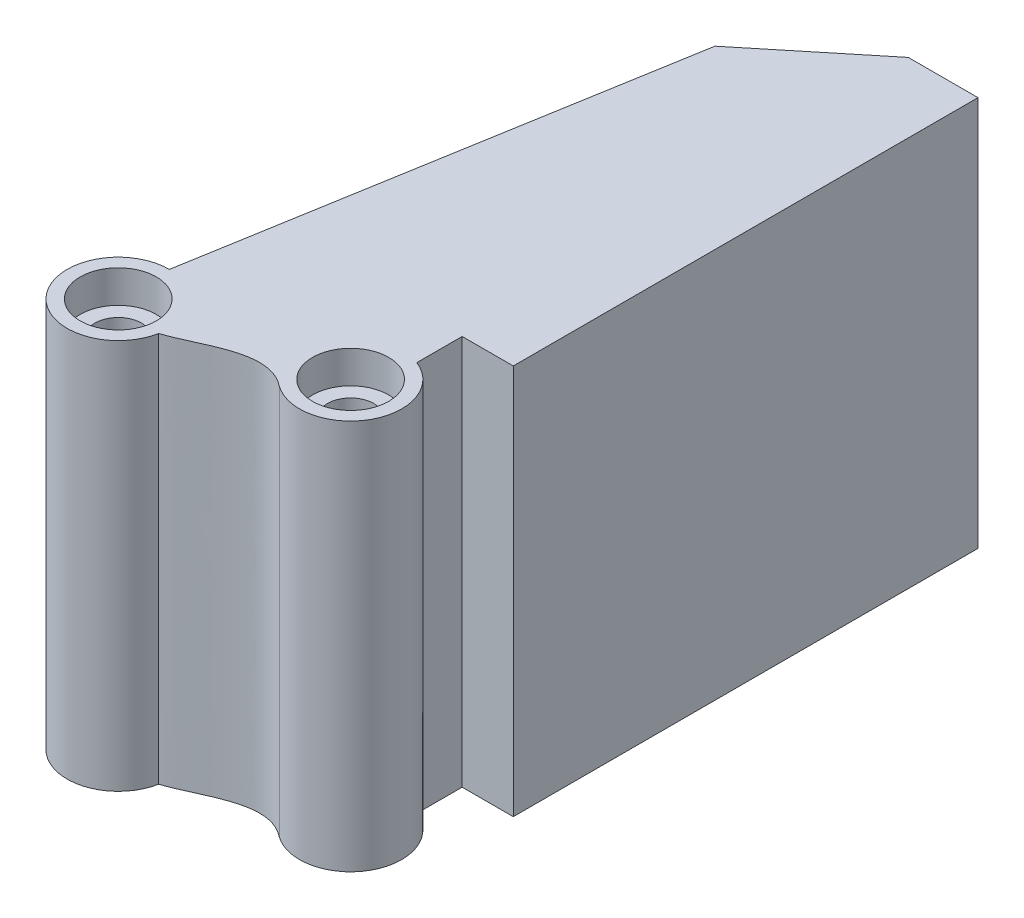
ISO-10303-21;
HEADER;
FILE_DESCRIPTION(('STEP AP214'),'2;1');
FILE_NAME('part.step','',(''),(''),'','','');
FILE_SCHEMA(('AUTOMOTIVE_DESIGN { 1 0 10303 214 1 1 1 1 }'));
ENDSEC;
DATA;
#1=APPLICATION_CONTEXT('core data for automotive mechanical design processes');
#2=APPLICATION_PROTOCOL_DEFINITION('international standard','automotive_design',2000,#1);
#3=PRODUCT_CONTEXT('',#1,'mechanical');
#4=PRODUCT('Part','Part','',(#3));
#5=PRODUCT_RELATED_PRODUCT_CATEGORY('part','',(#4));
#6=PRODUCT_DEFINITION_FORMATION('','',#4);
#7=PRODUCT_DEFINITION_CONTEXT('part definition',#1,'design');
#8=PRODUCT_DEFINITION('design','',#6,#7);
#9=PRODUCT_DEFINITION_SHAPE('','',#8);
#10=(LENGTH_UNIT() NAMED_UNIT(*) SI_UNIT(.MILLI.,.METRE.));
#11=(NAMED_UNIT(*) PLANE_ANGLE_UNIT() SI_UNIT($,.RADIAN.));
#12=(NAMED_UNIT(*) SI_UNIT($,.STERADIAN.) SOLID_ANGLE_UNIT());
#13=UNCERTAINTY_MEASURE_WITH_UNIT(LENGTH_MEASURE(1.E-05),#10,'distance_accuracy_value','');
#14=(GEOMETRIC_REPRESENTATION_CONTEXT(3) GLOBAL_UNCERTAINTY_ASSIGNED_CONTEXT((#13)) GLOBAL_UNIT_ASSIGNED_CONTEXT((#10,
#11,#12)) REPRESENTATION_CONTEXT('',''));
#15=CARTESIAN_POINT('',(0.,0.,0.));
#16=DIRECTION('',(0.,0.,1.));
#17=DIRECTION('',(1.,0.,0.));
#18=AXIS2_PLACEMENT_3D('',#15,#16,#17);
#19=CARTESIAN_POINT('',(-7.5,21.,-91.3416008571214));
#20=DIRECTION('',(0.,-1.,0.));
#21=DIRECTION('',(0.,0.,-1.));
#22=AXIS2_PLACEMENT_3D('',#19,#20,#21);
#23=CYLINDRICAL_SURFACE('',#22,2.5);
#24=CARTESIAN_POINT('',(-7.5,17.5,-91.3416008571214));
#25=DIRECTION('',(0.,1.,0.));
#26=DIRECTION('',(0.,0.,1.));
#27=AXIS2_PLACEMENT_3D('',#24,#25,#26);
#28=CIRCLE('',#27,2.5);
#29=CARTESIAN_POINT('',(-7.5,17.5,-93.8416008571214));
#30=VERTEX_POINT('',#29);
#31=EDGE_CURVE('E272',#30,#30,#28,.T.);
#32=CARTESIAN_POINT('',(-7.5,-17.5,-91.3416008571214));
#33=DIRECTION('',(0.,-1.,0.));
#34=DIRECTION('',(0.,0.,-1.));
#35=AXIS2_PLACEMENT_3D('',#32,#33,#34);
#36=CIRCLE('',#35,2.5);
#37=CARTESIAN_POINT('',(-7.5,-17.5,-93.8416008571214));
#38=VERTEX_POINT('',#37);
#39=EDGE_CURVE('E119',#38,#38,#36,.T.);
#40=CARTESIAN_POINT('',(-7.5,17.5,-93.8416008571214));
#41=CARTESIAN_POINT('',(-7.5,17.1354166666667,-93.8416008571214));
#42=CARTESIAN_POINT('',(-7.5,16.7708333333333,-93.8416008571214));
#43=CARTESIAN_POINT('',(-7.5,16.0416666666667,-93.8416008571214));
#44=CARTESIAN_POINT('',(-7.5,15.6770833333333,-93.8416008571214));
#45=CARTESIAN_POINT('',(-7.5,14.9479166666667,-93.8416008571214));
#46=CARTESIAN_POINT('',(-7.5,14.5833333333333,-93.8416008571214));
#47=CARTESIAN_POINT('',(-7.5,13.8541666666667,-93.8416008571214));
#48=CARTESIAN_POINT('',(-7.5,13.4895833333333,-93.8416008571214));
#49=CARTESIAN_POINT('',(-7.5,12.7604166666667,-93.8416008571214));
#50=CARTESIAN_POINT('',(-7.5,12.3958333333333,-93.8416008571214));
#51=CARTESIAN_POINT('',(-7.5,11.6666666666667,-93.8416008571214));
#52=CARTESIAN_POINT('',(-7.5,11.3020833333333,-93.8416008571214));
#53=CARTESIAN_POINT('',(-7.5,10.5729166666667,-93.8416008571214));
#54=CARTESIAN_POINT('',(-7.5,10.2083333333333,-93.8416008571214));
#55=CARTESIAN_POINT('',(-7.5,9.47916666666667,-93.8416008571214));
#56=CARTESIAN_POINT('',(-7.5,9.11458333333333,-93.8416008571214));
#57=CARTESIAN_POINT('',(-7.5,8.38541666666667,-93.8416008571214));
#58=CARTESIAN_POINT('',(-7.5,8.02083333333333,-93.8416008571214));
#59=CARTESIAN_POINT('',(-7.5,7.29166666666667,-93.8416008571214));
#60=CARTESIAN_POINT('',(-7.5,6.92708333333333,-93.8416008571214));
#61=CARTESIAN_POINT('',(-7.5,6.19791666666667,-93.8416008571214));
#62=CARTESIAN_POINT('',(-7.5,5.83333333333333,-93.8416008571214));
#63=CARTESIAN_POINT('',(-7.5,5.10416666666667,-93.8416008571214));
#64=CARTESIAN_POINT('',(-7.5,4.73958333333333,-93.8416008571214));
#65=CARTESIAN_POINT('',(-7.5,4.01041666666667,-93.8416008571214));
#66=CARTESIAN_POINT('',(-7.5,3.64583333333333,-93.8416008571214));
#67=CARTESIAN_POINT('',(-7.5,2.91666666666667,-93.8416008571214));
#68=CARTESIAN_POINT('',(-7.5,2.55208333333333,-93.8416008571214));
#69=CARTESIAN_POINT('',(-7.5,1.82291666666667,-93.8416008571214));
#70=CARTESIAN_POINT('',(-7.5,1.45833333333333,-93.8416008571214));
#71=CARTESIAN_POINT('',(-7.5,0.729166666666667,-93.8416008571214));
#72=CARTESIAN_POINT('',(-7.5,0.364583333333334,-93.8416008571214));
#73=CARTESIAN_POINT('',(-7.5,-0.364583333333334,-93.8416008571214));
#74=CARTESIAN_POINT('',(-7.5,-0.729166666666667,-93.8416008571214));
#75=CARTESIAN_POINT('',(-7.5,-1.45833333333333,-93.8416008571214));
#76=CARTESIAN_POINT('',(-7.5,-1.82291666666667,-93.8416008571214));
#77=CARTESIAN_POINT('',(-7.5,-2.55208333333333,-93.8416008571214));
#78=CARTESIAN_POINT('',(-7.5,-2.91666666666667,-93.8416008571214));
#79=CARTESIAN_POINT('',(-7.5,-3.64583333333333,-93.8416008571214));
#80=CARTESIAN_POINT('',(-7.5,-4.01041666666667,-93.8416008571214));
#81=CARTESIAN_POINT('',(-7.5,-4.73958333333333,-93.8416008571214));
#82=CARTESIAN_POINT('',(-7.5,-5.10416666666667,-93.8416008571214));
#83=CARTESIAN_POINT('',(-7.5,-5.83333333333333,-93.8416008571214));
#84=CARTESIAN_POINT('',(-7.5,-6.19791666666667,-93.8416008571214));
#85=CARTESIAN_POINT('',(-7.5,-6.92708333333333,-93.8416008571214));
#86=CARTESIAN_POINT('',(-7.5,-7.29166666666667,-93.8416008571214));
#87=CARTESIAN_POINT('',(-7.5,-8.02083333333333,-93.8416008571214));
#88=CARTESIAN_POINT('',(-7.5,-8.38541666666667,-93.8416008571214));
#89=CARTESIAN_POINT('',(-7.5,-9.11458333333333,-93.8416008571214));
#90=CARTESIAN_POINT('',(-7.5,-9.47916666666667,-93.8416008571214));
#91=CARTESIAN_POINT('',(-7.5,-10.2083333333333,-93.8416008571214));
#92=CARTESIAN_POINT('',(-7.5,-10.5729166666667,-93.8416008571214));
#93=CARTESIAN_POINT('',(-7.5,-11.3020833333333,-93.8416008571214));
#94=CARTESIAN_POINT('',(-7.5,-11.6666666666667,-93.8416008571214));
#95=CARTESIAN_POINT('',(-7.5,-12.3958333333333,-93.8416008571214));
#96=CARTESIAN_POINT('',(-7.5,-12.7604166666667,-93.8416008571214));
#97=CARTESIAN_POINT('',(-7.5,-13.4895833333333,-93.8416008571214));
#98=CARTESIAN_POINT('',(-7.5,-13.8541666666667,-93.8416008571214));
#99=CARTESIAN_POINT('',(-7.5,-14.5833333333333,-93.8416008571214));
#100=CARTESIAN_POINT('',(-7.5,-14.9479166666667,-93.8416008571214));
#101=CARTESIAN_POINT('',(-7.5,-15.6770833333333,-93.8416008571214));
#102=CARTESIAN_POINT('',(-7.5,-16.0416666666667,-93.8416008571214));
#103=CARTESIAN_POINT('',(-7.5,-16.7708333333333,-93.8416008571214));
#104=CARTESIAN_POINT('',(-7.5,-17.1354166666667,-93.8416008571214));
#105=CARTESIAN_POINT('',(-7.5,-17.5,-93.8416008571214));
#106=B_SPLINE_CURVE_WITH_KNOTS('',3,(#40,#41,#42,#43,#44,#45,#46,#47,#48,#49,#50,#51,#52,#53,
#54,#55,#56,#57,#58,#59,#60,#61,#62,#63,#64,#65,#66,#67,#68,#69,#70,#71,#72,#73,#74,#75,#76,#77,
#78,#79,#80,#81,#82,#83,#84,#85,#86,#87,#88,#89,#90,#91,#92,#93,#94,#95,#96,#97,#98,#99,#100,
#101,#102,#103,#104,#105),.UNSPECIFIED.,.F.,.F.,(4,2,2,2,2,2,2,2,2,2,2,2,2,2,2,2,2,2,2,2,2,2,2,
2,2,2,2,2,2,2,2,2,4),(0.,1.09375,2.1875,3.28125,4.375,5.46875,6.5625,7.65625,8.75,9.84375,
10.9375,12.03125,13.125,14.21875,15.3125,16.40625,17.5,18.59375,19.6875,20.78125,21.875,
22.96875,24.0625,25.15625,26.25,27.34375,28.4375,29.53125,30.625,31.71875,32.8125,33.90625,35.),.UNSPECIFIED.);
#107=EDGE_CURVE('BSEAM115',#30,#38,#106,.T.);
#108=ORIENTED_EDGE('',*,*,#31,.T.);
#109=ORIENTED_EDGE('',*,*,#39,.T.);
#110=ORIENTED_EDGE('',*,*,#107,.T.);
#111=ORIENTED_EDGE('',*,*,#107,.F.);
#112=EDGE_LOOP('',(#108,#110,#109,#111));
#113=FACE_BOUND('',#112,.T.);
#114=ADVANCED_FACE('F115',(#113),#23,.F.);
#115=CARTESIAN_POINT('',(-27.5,21.,-86.3416008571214));
#116=DIRECTION('',(0.,-1.,0.));
#117=DIRECTION('',(0.,0.,-1.));
#118=AXIS2_PLACEMENT_3D('',#115,#116,#117);
#119=CYLINDRICAL_SURFACE('',#118,2.5);
#120=CARTESIAN_POINT('',(-27.5,17.5,-86.3416008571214));
#121=DIRECTION('',(0.,1.,0.));
#122=DIRECTION('',(0.,0.,1.));
#123=AXIS2_PLACEMENT_3D('',#120,#121,#122);
#124=CIRCLE('',#123,2.5);
#125=CARTESIAN_POINT('',(-27.5,17.5,-88.8416008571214));
#126=VERTEX_POINT('',#125);
#127=EDGE_CURVE('E290',#126,#126,#124,.T.);
#128=CARTESIAN_POINT('',(-27.5,-17.5,-86.3416008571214));
#129=DIRECTION('',(0.,-1.,0.));
#130=DIRECTION('',(0.,0.,-1.));
#131=AXIS2_PLACEMENT_3D('',#128,#129,#130);
#132=CIRCLE('',#131,2.5);
#133=CARTESIAN_POINT('',(-27.5,-17.5,-88.8416008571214));
#134=VERTEX_POINT('',#133);
#135=EDGE_CURVE('E277',#134,#134,#132,.T.);
#136=CARTESIAN_POINT('',(-27.5,17.5,-88.8416008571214));
#137=CARTESIAN_POINT('',(-27.5,17.1354166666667,-88.8416008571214));
#138=CARTESIAN_POINT('',(-27.5,16.7708333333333,-88.8416008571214));
#139=CARTESIAN_POINT('',(-27.5,16.0416666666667,-88.8416008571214));
#140=CARTESIAN_POINT('',(-27.5,15.6770833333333,-88.8416008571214));
#141=CARTESIAN_POINT('',(-27.5,14.9479166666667,-88.8416008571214));
#142=CARTESIAN_POINT('',(-27.5,14.5833333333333,-88.8416008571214));
#143=CARTESIAN_POINT('',(-27.5,13.8541666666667,-88.8416008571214));
#144=CARTESIAN_POINT('',(-27.5,13.4895833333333,-88.8416008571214));
#145=CARTESIAN_POINT('',(-27.5,12.7604166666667,-88.8416008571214));
#146=CARTESIAN_POINT('',(-27.5,12.3958333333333,-88.8416008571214));
#147=CARTESIAN_POINT('',(-27.5,11.6666666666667,-88.8416008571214));
#148=CARTESIAN_POINT('',(-27.5,11.3020833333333,-88.8416008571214));
#149=CARTESIAN_POINT('',(-27.5,10.5729166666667,-88.8416008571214));
#150=CARTESIAN_POINT('',(-27.5,10.2083333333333,-88.8416008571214));
#151=CARTESIAN_POINT('',(-27.5,9.47916666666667,-88.8416008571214));
#152=CARTESIAN_POINT('',(-27.5,9.11458333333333,-88.8416008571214));
#153=CARTESIAN_POINT('',(-27.5,8.38541666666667,-88.8416008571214));
#154=CARTESIAN_POINT('',(-27.5,8.02083333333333,-88.8416008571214));
#155=CARTESIAN_POINT('',(-27.5,7.29166666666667,-88.8416008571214));
#156=CARTESIAN_POINT('',(-27.5,6.92708333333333,-88.8416008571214));
#157=CARTESIAN_POINT('',(-27.5,6.19791666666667,-88.8416008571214));
#158=CARTESIAN_POINT('',(-27.5,5.83333333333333,-88.8416008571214));
#159=CARTESIAN_POINT('',(-27.5,5.10416666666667,-88.8416008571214));
#160=CARTESIAN_POINT('',(-27.5,4.73958333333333,-88.8416008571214));
#161=CARTESIAN_POINT('',(-27.5,4.01041666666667,-88.8416008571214));
#162=CARTESIAN_POINT('',(-27.5,3.64583333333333,-88.8416008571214));
#163=CARTESIAN_POINT('',(-27.5,2.91666666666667,-88.8416008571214));
#164=CARTESIAN_POINT('',(-27.5,2.55208333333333,-88.8416008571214));
#165=CARTESIAN_POINT('',(-27.5,1.82291666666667,-88.8416008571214));
#166=CARTESIAN_POINT('',(-27.5,1.45833333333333,-88.8416008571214));
#167=CARTESIAN_POINT('',(-27.5,0.729166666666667,-88.8416008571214));
#168=CARTESIAN_POINT('',(-27.5,0.364583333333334,-88.8416008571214));
#169=CARTESIAN_POINT('',(-27.5,-0.364583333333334,-88.8416008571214));
#170=CARTESIAN_POINT('',(-27.5,-0.729166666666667,-88.8416008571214));
#171=CARTESIAN_POINT('',(-27.5,-1.45833333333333,-88.8416008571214));
#172=CARTESIAN_POINT('',(-27.5,-1.82291666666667,-88.8416008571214));
#173=CARTESIAN_POINT('',(-27.5,-2.55208333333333,-88.8416008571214));
#174=CARTESIAN_POINT('',(-27.5,-2.91666666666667,-88.8416008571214));
#175=CARTESIAN_POINT('',(-27.5,-3.64583333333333,-88.8416008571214));
#176=CARTESIAN_POINT('',(-27.5,-4.01041666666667,-88.8416008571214));
#177=CARTESIAN_POINT('',(-27.5,-4.73958333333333,-88.8416008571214));
#178=CARTESIAN_POINT('',(-27.5,-5.10416666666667,-88.8416008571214));
#179=CARTESIAN_POINT('',(-27.5,-5.83333333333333,-88.8416008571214));
#180=CARTESIAN_POINT('',(-27.5,-6.19791666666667,-88.8416008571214));
#181=CARTESIAN_POINT('',(-27.5,-6.92708333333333,-88.8416008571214));
#182=CARTESIAN_POINT('',(-27.5,-7.29166666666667,-88.8416008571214));
#183=CARTESIAN_POINT('',(-27.5,-8.02083333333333,-88.8416008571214));
#184=CARTESIAN_POINT('',(-27.5,-8.38541666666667,-88.8416008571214));
#185=CARTESIAN_POINT('',(-27.5,-9.11458333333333,-88.8416008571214));
#186=CARTESIAN_POINT('',(-27.5,-9.47916666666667,-88.8416008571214));
#187=CARTESIAN_POINT('',(-27.5,-10.2083333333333,-88.8416008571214));
#188=CARTESIAN_POINT('',(-27.5,-10.5729166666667,-88.8416008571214));
#189=CARTESIAN_POINT('',(-27.5,-11.3020833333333,-88.8416008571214));
#190=CARTESIAN_POINT('',(-27.5,-11.6666666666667,-88.8416008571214));
#191=CARTESIAN_POINT('',(-27.5,-12.3958333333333,-88.8416008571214));
#192=CARTESIAN_POINT('',(-27.5,-12.7604166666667,-88.8416008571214));
#193=CARTESIAN_POINT('',(-27.5,-13.4895833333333,-88.8416008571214));
#194=CARTESIAN_POINT('',(-27.5,-13.8541666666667,-88.8416008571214));
#195=CARTESIAN_POINT('',(-27.5,-14.5833333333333,-88.8416008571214));
#196=CARTESIAN_POINT('',(-27.5,-14.9479166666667,-88.8416008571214));
#197=CARTESIAN_POINT('',(-27.5,-15.6770833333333,-88.8416008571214));
#198=CARTESIAN_POINT('',(-27.5,-16.0416666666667,-88.8416008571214));
#199=CARTESIAN_POINT('',(-27.5,-16.7708333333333,-88.8416008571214));
#200=CARTESIAN_POINT('',(-27.5,-17.1354166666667,-88.8416008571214));
#201=CARTESIAN_POINT('',(-27.5,-17.5,-88.8416008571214));
#202=B_SPLINE_CURVE_WITH_KNOTS('',3,(#136,#137,#138,#139,#140,#141,#142,#143,#144,#145,#146,
#147,#148,#149,#150,#151,#152,#153,#154,#155,#156,#157,#158,#159,#160,#161,#162,#163,#164,#165,
#166,#167,#168,#169,#170,#171,#172,#173,#174,#175,#176,#177,#178,#179,#180,#181,#182,#183,#184,
#185,#186,#187,#188,#189,#190,#191,#192,#193,#194,#195,#196,#197,#198,#199,#200,#201),
.UNSPECIFIED.,.F.,.F.,(4,2,2,2,2,2,2,2,2,2,2,2,2,2,2,2,2,2,2,2,2,2,2,2,2,2,2,2,2,2,2,2,4),(0.,
1.09375,2.1875,3.28125,4.375,5.46875,6.5625,7.65625,8.75,9.84375,10.9375,12.03125,13.125,
14.21875,15.3125,16.40625,17.5,18.59375,19.6875,20.78125,21.875,22.96875,24.0625,25.15625,26.25,
27.34375,28.4375,29.53125,30.625,31.71875,32.8125,33.90625,35.),.UNSPECIFIED.);
#203=EDGE_CURVE('BSEAM117',#126,#134,#202,.T.);
#204=ORIENTED_EDGE('',*,*,#127,.T.);
#205=ORIENTED_EDGE('',*,*,#135,.T.);
#206=ORIENTED_EDGE('',*,*,#203,.T.);
#207=ORIENTED_EDGE('',*,*,#203,.F.);
#208=EDGE_LOOP('',(#204,#206,#205,#207));
#209=FACE_BOUND('',#208,.T.);
#210=ADVANCED_FACE('F117',(#209),#119,.F.);
#211=CARTESIAN_POINT('',(-5.5,21.,0.));
#212=DIRECTION('',(1.,0.,0.));
#213=DIRECTION('',(0.,0.,-1.));
#214=AXIS2_PLACEMENT_3D('',#211,#212,#213);
#215=PLANE('',#214);
#216=DIRECTION('',(0.,0.,1.));
#217=VECTOR('',#216,1.);
#218=CARTESIAN_POINT('',(-5.5,-21.,0.));
#219=LINE('',#218,#217);
#220=CARTESIAN_POINT('',(-5.5,-21.,-101.341600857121));
#221=VERTEX_POINT('',#220);
#222=CARTESIAN_POINT('',(-5.5,-21.,-96.4650762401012));
#223=VERTEX_POINT('',#222);
#224=EDGE_CURVE('E325',#221,#223,#219,.T.);
#225=ORIENTED_EDGE('',*,*,#224,.F.);
#226=DIRECTION('',(0.,-1.,0.));
#227=VECTOR('',#226,1.);
#228=CARTESIAN_POINT('',(-5.5,21.,-101.341600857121));
#229=LINE('',#228,#227);
#230=CARTESIAN_POINT('',(-5.5,21.,-101.341600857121));
#231=VERTEX_POINT('',#230);
#232=EDGE_CURVE('E125',#231,#221,#229,.T.);
#233=ORIENTED_EDGE('',*,*,#232,.F.);
#234=DIRECTION('',(0.,0.,1.));
#235=VECTOR('',#234,1.);
#236=CARTESIAN_POINT('',(-5.5,21.,0.));
#237=LINE('',#236,#235);
#238=CARTESIAN_POINT('',(-5.5,21.,-96.4650762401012));
#239=VERTEX_POINT('',#238);
#240=EDGE_CURVE('E343',#231,#239,#237,.T.);
#241=ORIENTED_EDGE('',*,*,#240,.T.);
#242=DIRECTION('',(0.,-1.,0.));
#243=VECTOR('',#242,1.);
#244=CARTESIAN_POINT('',(-5.5,21.,-96.4650762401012));
#245=LINE('',#244,#243);
#246=EDGE_CURVE('E12',#239,#223,#245,.T.);
#247=ORIENTED_EDGE('',*,*,#246,.T.);
#248=EDGE_LOOP('',(#225,#233,#241,#247));
#249=FACE_BOUND('',#248,.T.);
#250=ADVANCED_FACE('F253',(#249),#215,.T.);
#251=CARTESIAN_POINT('',(0.,21.,-101.341600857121));
#252=DIRECTION('',(0.,0.,1.));
#253=DIRECTION('',(1.,0.,0.));
#254=AXIS2_PLACEMENT_3D('',#251,#252,#253);
#255=PLANE('',#254);
#256=DIRECTION('',(-1.,0.,0.));
#257=VECTOR('',#256,1.);
#258=CARTESIAN_POINT('',(0.,-21.,-101.341600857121));
#259=LINE('',#258,#257);
#260=CARTESIAN_POINT('',(0.,-21.,-101.341600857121));
#261=VERTEX_POINT('',#260);
#262=EDGE_CURVE('E323',#261,#221,#259,.T.);
#263=ORIENTED_EDGE('',*,*,#262,.F.);
#264=DIRECTION('',(0.,-1.,0.));
#265=VECTOR('',#264,1.);
#266=CARTESIAN_POINT('',(0.,21.,-101.341600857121));
#267=LINE('',#266,#265);
#268=CARTESIAN_POINT('',(0.,21.,-101.341600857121));
#269=VERTEX_POINT('',#268);
#270=EDGE_CURVE('E295',#269,#261,#267,.T.);
#271=ORIENTED_EDGE('',*,*,#270,.F.);
#272=DIRECTION('',(-1.,0.,0.));
#273=VECTOR('',#272,1.);
#274=CARTESIAN_POINT('',(0.,21.,-101.341600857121));
#275=LINE('',#274,#273);
#276=EDGE_CURVE('E342',#269,#231,#275,.T.);
#277=ORIENTED_EDGE('',*,*,#276,.T.);
#278=ORIENTED_EDGE('',*,*,#232,.T.);
#279=EDGE_LOOP('',(#263,#271,#277,#278));
#280=FACE_BOUND('',#279,.T.);
#281=ADVANCED_FACE('F249',(#280),#255,.T.);
#282=CARTESIAN_POINT('',(0.,21.,0.));
#283=DIRECTION('',(1.,0.,0.));
#284=DIRECTION('',(0.,0.,-1.));
#285=AXIS2_PLACEMENT_3D('',#282,#283,#284);
#286=PLANE('',#285);
#287=DIRECTION('',(0.,0.,1.));
#288=VECTOR('',#287,1.);
#289=CARTESIAN_POINT('',(0.,-21.,0.));
#290=LINE('',#289,#288);
#291=CARTESIAN_POINT('',(0.,-21.,-151.341600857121));
#292=VERTEX_POINT('',#291);
#293=EDGE_CURVE('E320',#292,#261,#290,.T.);
#294=ORIENTED_EDGE('',*,*,#293,.F.);
#295=DIRECTION('',(0.,-1.,0.));
#296=VECTOR('',#295,1.);
#297=CARTESIAN_POINT('',(0.,21.,-151.341600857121));
#298=LINE('',#297,#296);
#299=CARTESIAN_POINT('',(0.,21.,-151.341600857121));
#300=VERTEX_POINT('',#299);
#301=EDGE_CURVE('E297',#300,#292,#298,.T.);
#302=ORIENTED_EDGE('',*,*,#301,.F.);
#303=DIRECTION('',(0.,0.,1.));
#304=VECTOR('',#303,1.);
#305=CARTESIAN_POINT('',(0.,21.,0.));
#306=LINE('',#305,#304);
#307=EDGE_CURVE('E338',#300,#269,#306,.T.);
#308=ORIENTED_EDGE('',*,*,#307,.T.);
#309=ORIENTED_EDGE('',*,*,#270,.T.);
#310=EDGE_LOOP('',(#294,#302,#308,#309));
#311=FACE_BOUND('',#310,.T.);
#312=ADVANCED_FACE('F245',(#311),#286,.T.);
#313=CARTESIAN_POINT('',(0.,21.,-151.341600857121));
#314=DIRECTION('',(0.,0.,1.));
#315=DIRECTION('',(1.,0.,0.));
#316=AXIS2_PLACEMENT_3D('',#313,#314,#315);
#317=PLANE('',#316);
#318=DIRECTION('',(-1.,0.,0.));
#319=VECTOR('',#318,1.);
#320=CARTESIAN_POINT('',(0.,-21.,-151.341600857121));
#321=LINE('',#320,#319);
#322=CARTESIAN_POINT('',(-7.5,-21.,-151.341600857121));
#323=VERTEX_POINT('',#322);
#324=EDGE_CURVE('E318',#292,#323,#321,.T.);
#325=ORIENTED_EDGE('',*,*,#324,.T.);
#326=DIRECTION('',(0.,-1.,0.));
#327=VECTOR('',#326,1.);
#328=CARTESIAN_POINT('',(-7.5,21.,-151.341600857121));
#329=LINE('',#328,#327);
#330=CARTESIAN_POINT('',(-7.5,21.,-151.341600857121));
#331=VERTEX_POINT('',#330);
#332=EDGE_CURVE('E299',#331,#323,#329,.T.);
#333=ORIENTED_EDGE('',*,*,#332,.F.);
#334=DIRECTION('',(-1.,0.,0.));
#335=VECTOR('',#334,1.);
#336=CARTESIAN_POINT('',(0.,21.,-151.341600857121));
#337=LINE('',#336,#335);
#338=EDGE_CURVE('E335',#300,#331,#337,.T.);
#339=ORIENTED_EDGE('',*,*,#338,.F.);
#340=ORIENTED_EDGE('',*,*,#301,.T.);
#341=EDGE_LOOP('',(#325,#333,#339,#340));
#342=FACE_BOUND('',#341,.T.);
#343=ADVANCED_FACE('F241',(#342),#317,.F.);
#344=CARTESIAN_POINT('',(-77.1572085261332,21.,-94.4195143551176));
#345=DIRECTION('',(0.632770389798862,0.,0.774339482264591));
#346=DIRECTION('',(0.774339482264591,0.,-0.632770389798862));
#347=AXIS2_PLACEMENT_3D('',#344,#345,#346);
#348=PLANE('',#347);
#349=DIRECTION('',(-0.774339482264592,0.,0.632770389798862));
#350=VECTOR('',#349,1.);
#351=CARTESIAN_POINT('',(-77.1572085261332,-21.,-94.4195143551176));
#352=LINE('',#351,#350);
#353=CARTESIAN_POINT('',(-18.9496049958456,-21.,-141.985276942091));
#354=VERTEX_POINT('',#353);
#355=EDGE_CURVE('E316',#323,#354,#352,.T.);
#356=ORIENTED_EDGE('',*,*,#355,.T.);
#357=DIRECTION('',(0.,-1.,0.));
#358=VECTOR('',#357,1.);
#359=CARTESIAN_POINT('',(-18.9496049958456,21.,-141.985276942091));
#360=LINE('',#359,#358);
#361=CARTESIAN_POINT('',(-18.9496049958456,21.,-141.985276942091));
#362=VERTEX_POINT('',#361);
#363=EDGE_CURVE('E211',#362,#354,#360,.T.);
#364=ORIENTED_EDGE('',*,*,#363,.F.);
#365=DIRECTION('',(-0.774339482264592,0.,0.632770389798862));
#366=VECTOR('',#365,1.);
#367=CARTESIAN_POINT('',(-77.1572085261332,21.,-94.4195143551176));
#368=LINE('',#367,#366);
#369=EDGE_CURVE('E199',#331,#362,#368,.T.);
#370=ORIENTED_EDGE('',*,*,#369,.F.);
#371=ORIENTED_EDGE('',*,*,#332,.T.);
#372=EDGE_LOOP('',(#356,#364,#370,#371));
#373=FACE_BOUND('',#372,.T.);
#374=ADVANCED_FACE('F238',(#373),#348,.F.);
#375=CARTESIAN_POINT('',(-41.9411424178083,21.,-7.15171608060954));
#376=DIRECTION('',(0.985771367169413,0.,0.168091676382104));
#377=DIRECTION('',(0.168091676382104,0.,-0.985771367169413));
#378=AXIS2_PLACEMENT_3D('',#375,#376,#377);
#379=PLANE('',#378);
#380=DIRECTION('',(-0.168091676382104,0.,0.985771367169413));
#381=VECTOR('',#380,1.);
#382=CARTESIAN_POINT('',(-41.9411424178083,-21.,-7.15171608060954));
#383=LINE('',#382,#381);
#384=CARTESIAN_POINT('',(-27.5,-21.,-91.8416008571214));
#385=VERTEX_POINT('',#384);
#386=EDGE_CURVE('E208',#354,#385,#383,.T.);
#387=ORIENTED_EDGE('',*,*,#386,.T.);
#388=DIRECTION('',(0.,-1.,0.));
#389=VECTOR('',#388,1.);
#390=CARTESIAN_POINT('',(-27.5,21.,-91.8416008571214));
#391=LINE('',#390,#389);
#392=CARTESIAN_POINT('',(-27.5,21.,-91.8416008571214));
#393=VERTEX_POINT('',#392);
#394=EDGE_CURVE('E205',#393,#385,#391,.T.);
#395=ORIENTED_EDGE('',*,*,#394,.F.);
#396=DIRECTION('',(-0.168091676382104,0.,0.985771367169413));
#397=VECTOR('',#396,1.);
#398=CARTESIAN_POINT('',(-41.9411424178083,21.,-7.15171608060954));
#399=LINE('',#398,#397);
#400=EDGE_CURVE('E193',#362,#393,#399,.T.);
#401=ORIENTED_EDGE('',*,*,#400,.F.);
#402=ORIENTED_EDGE('',*,*,#363,.T.);
#403=EDGE_LOOP('',(#387,#395,#401,#402));
#404=FACE_BOUND('',#403,.T.);
#405=ADVANCED_FACE('F206',(#404),#379,.F.);
#406=CARTESIAN_POINT('',(-27.5,21.,-86.3416008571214));
#407=DIRECTION('',(0.,-1.,0.));
#408=DIRECTION('',(0.,0.,-1.));
#409=AXIS2_PLACEMENT_3D('',#406,#407,#408);
#410=CYLINDRICAL_SURFACE('',#409,5.5);
#411=CARTESIAN_POINT('',(-27.5,-21.,-86.3416008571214));
#412=DIRECTION('',(0.,1.,0.));
#413=DIRECTION('',(0.,0.,1.));
#414=AXIS2_PLACEMENT_3D('',#411,#412,#413);
#415=CIRCLE('',#414,5.5);
#416=CARTESIAN_POINT('',(-22.1020718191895,-21.,-85.2869106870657));
#417=VERTEX_POINT('',#416);
#418=EDGE_CURVE('E310',#385,#417,#415,.T.);
#419=ORIENTED_EDGE('',*,*,#418,.T.);
#420=DIRECTION('',(0.,-1.,0.));
#421=VECTOR('',#420,1.);
#422=CARTESIAN_POINT('',(-22.1020718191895,21.,-85.2869106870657));
#423=LINE('',#422,#421);
#424=CARTESIAN_POINT('',(-22.1020718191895,21.,-85.2869106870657));
#425=VERTEX_POINT('',#424);
#426=EDGE_CURVE('E163',#425,#417,#423,.T.);
#427=ORIENTED_EDGE('',*,*,#426,.F.);
#428=CARTESIAN_POINT('',(-27.5,21.,-86.3416008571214));
#429=DIRECTION('',(0.,1.,0.));
#430=DIRECTION('',(0.,0.,1.));
#431=AXIS2_PLACEMENT_3D('',#428,#429,#430);
#432=CIRCLE('',#431,5.5);
#433=EDGE_CURVE('E197',#393,#425,#432,.T.);
#434=ORIENTED_EDGE('',*,*,#433,.F.);
#435=ORIENTED_EDGE('',*,*,#394,.T.);
#436=EDGE_LOOP('',(#419,#427,#434,#435));
#437=FACE_BOUND('',#436,.T.);
#438=ADVANCED_FACE('F213',(#437),#410,.T.);
#439=CARTESIAN_POINT('',(-10.7139236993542,21.,-86.8783403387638));
#440=CARTESIAN_POINT('',(-14.3726215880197,21.,-89.7782193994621));
#441=CARTESIAN_POINT('',(-18.7035067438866,21.,-86.3817029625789));
#442=CARTESIAN_POINT('',(-22.1020718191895,21.,-85.2869106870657));
#443=B_SPLINE_CURVE_WITH_KNOTS('',3,(#439,#440,#441,#442),.UNSPECIFIED.,.F.,.F.,(4,4),(0.,1.),.UNSPECIFIED.);
#444=DIRECTION('',(0.,-1.,0.));
#445=VECTOR('',#444,1.);
#446=SURFACE_OF_LINEAR_EXTRUSION('',#443,#445);
#447=CARTESIAN_POINT('',(-10.7139236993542,-21.,-86.8783403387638));
#448=CARTESIAN_POINT('',(-14.3726215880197,-21.,-89.7782193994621));
#449=CARTESIAN_POINT('',(-18.7035067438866,-21.,-86.3817029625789));
#450=CARTESIAN_POINT('',(-22.1020718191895,-21.,-85.2869106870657));
#451=B_SPLINE_CURVE_WITH_KNOTS('',3,(#447,#448,#449,#450),.UNSPECIFIED.,.F.,.F.,(4,4),(0.,1.),.UNSPECIFIED.);
#452=CARTESIAN_POINT('',(-10.7139236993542,-21.,-86.8783403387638));
#453=VERTEX_POINT('',#452);
#454=EDGE_CURVE('E305',#453,#417,#451,.T.);
#455=ORIENTED_EDGE('',*,*,#454,.F.);
#456=DIRECTION('',(0.,-1.,0.));
#457=VECTOR('',#456,1.);
#458=CARTESIAN_POINT('',(-10.7139236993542,21.,-86.8783403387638));
#459=LINE('',#458,#457);
#460=CARTESIAN_POINT('',(-10.7139236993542,21.,-86.8783403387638));
#461=VERTEX_POINT('',#460);
#462=EDGE_CURVE('E134',#461,#453,#459,.T.);
#463=ORIENTED_EDGE('',*,*,#462,.F.);
#464=EDGE_CURVE('E214',#461,#425,#443,.T.);
#465=ORIENTED_EDGE('',*,*,#464,.T.);
#466=ORIENTED_EDGE('',*,*,#426,.T.);
#467=EDGE_LOOP('',(#455,#463,#465,#466));
#468=FACE_BOUND('',#467,.T.);
#469=ADVANCED_FACE('F228',(#468),#446,.T.);
#470=CARTESIAN_POINT('',(-7.5,21.,-91.3416008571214));
#471=DIRECTION('',(0.,-1.,0.));
#472=DIRECTION('',(0.,0.,-1.));
#473=AXIS2_PLACEMENT_3D('',#470,#471,#472);
#474=CYLINDRICAL_SURFACE('',#473,5.5);
#475=CARTESIAN_POINT('',(-7.5,-21.,-91.3416008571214));
#476=DIRECTION('',(0.,1.,0.));
#477=DIRECTION('',(0.,0.,1.));
#478=AXIS2_PLACEMENT_3D('',#475,#476,#477);
#479=CIRCLE('',#478,5.5);
#480=EDGE_CURVE('E222',#453,#223,#479,.T.);
#481=ORIENTED_EDGE('',*,*,#480,.T.);
#482=ORIENTED_EDGE('',*,*,#246,.F.);
#483=CARTESIAN_POINT('',(-7.5,21.,-91.3416008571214));
#484=DIRECTION('',(0.,1.,0.));
#485=DIRECTION('',(0.,0.,1.));
#486=AXIS2_PLACEMENT_3D('',#483,#484,#485);
#487=CIRCLE('',#486,5.5);
#488=EDGE_CURVE('E175',#461,#239,#487,.T.);
#489=ORIENTED_EDGE('',*,*,#488,.F.);
#490=ORIENTED_EDGE('',*,*,#462,.T.);
#491=EDGE_LOOP('',(#481,#482,#489,#490));
#492=FACE_BOUND('',#491,.T.);
#493=ADVANCED_FACE('F232',(#492),#474,.T.);
#494=CARTESIAN_POINT('',(0.,-21.,0.));
#495=DIRECTION('',(0.,1.,0.));
#496=DIRECTION('',(0.,0.,1.));
#497=AXIS2_PLACEMENT_3D('',#494,#495,#496);
#498=PLANE('',#497);
#499=CARTESIAN_POINT('',(-27.5,-21.,-86.3416008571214));
#500=DIRECTION('',(0.,-1.,0.));
#501=DIRECTION('',(0.,0.,-1.));
#502=AXIS2_PLACEMENT_3D('',#499,#500,#501);
#503=CIRCLE('',#502,4.10000000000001);
#504=CARTESIAN_POINT('',(-27.5,-21.,-90.4416008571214));
#505=VERTEX_POINT('',#504);
#506=EDGE_CURVE('E286',#505,#505,#503,.T.);
#507=ORIENTED_EDGE('',*,*,#506,.F.);
#508=EDGE_LOOP('',(#507));
#509=FACE_BOUND('',#508,.T.);
#510=CARTESIAN_POINT('',(-7.5,-21.,-91.3416008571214));
#511=DIRECTION('',(0.,-1.,0.));
#512=DIRECTION('',(0.,0.,-1.));
#513=AXIS2_PLACEMENT_3D('',#510,#511,#512);
#514=CIRCLE('',#513,4.1);
#515=CARTESIAN_POINT('',(-7.5,-21.,-95.4416008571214));
#516=VERTEX_POINT('',#515);
#517=EDGE_CURVE('E357',#516,#516,#514,.T.);
#518=ORIENTED_EDGE('',*,*,#517,.F.);
#519=EDGE_LOOP('',(#518));
#520=FACE_BOUND('',#519,.T.);
#521=ORIENTED_EDGE('',*,*,#480,.F.);
#522=ORIENTED_EDGE('',*,*,#454,.T.);
#523=ORIENTED_EDGE('',*,*,#418,.F.);
#524=ORIENTED_EDGE('',*,*,#386,.F.);
#525=ORIENTED_EDGE('',*,*,#355,.F.);
#526=ORIENTED_EDGE('',*,*,#324,.F.);
#527=ORIENTED_EDGE('',*,*,#293,.T.);
#528=ORIENTED_EDGE('',*,*,#262,.T.);
#529=ORIENTED_EDGE('',*,*,#224,.T.);
#530=EDGE_LOOP('',(#521,#522,#523,#524,#525,#526,#527,#528,#529));
#531=FACE_BOUND('',#530,.T.);
#532=ADVANCED_FACE('F258',(#509,#520,#531),#498,.F.);
#533=CARTESIAN_POINT('',(0.,21.,0.));
#534=DIRECTION('',(0.,1.,0.));
#535=DIRECTION('',(0.,0.,1.));
#536=AXIS2_PLACEMENT_3D('',#533,#534,#535);
#537=PLANE('',#536);
#538=CARTESIAN_POINT('',(-27.5,21.,-86.3416008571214));
#539=DIRECTION('',(0.,1.,0.));
#540=DIRECTION('',(0.,0.,1.));
#541=AXIS2_PLACEMENT_3D('',#538,#539,#540);
#542=CIRCLE('',#541,4.10000000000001);
#543=CARTESIAN_POINT('',(-27.5,21.,-82.2416008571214));
#544=VERTEX_POINT('',#543);
#545=EDGE_CURVE('E352',#544,#544,#542,.T.);
#546=ORIENTED_EDGE('',*,*,#545,.F.);
#547=EDGE_LOOP('',(#546));
#548=FACE_BOUND('',#547,.T.);
#549=CARTESIAN_POINT('',(-7.5,21.,-91.3416008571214));
#550=DIRECTION('',(0.,1.,0.));
#551=DIRECTION('',(0.,0.,1.));
#552=AXIS2_PLACEMENT_3D('',#549,#550,#551);
#553=CIRCLE('',#552,4.1);
#554=CARTESIAN_POINT('',(-7.5,21.,-87.2416008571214));
#555=VERTEX_POINT('',#554);
#556=EDGE_CURVE('E276',#555,#555,#553,.T.);
#557=ORIENTED_EDGE('',*,*,#556,.F.);
#558=EDGE_LOOP('',(#557));
#559=FACE_BOUND('',#558,.T.);
#560=ORIENTED_EDGE('',*,*,#488,.T.);
#561=ORIENTED_EDGE('',*,*,#240,.F.);
#562=ORIENTED_EDGE('',*,*,#276,.F.);
#563=ORIENTED_EDGE('',*,*,#307,.F.);
#564=ORIENTED_EDGE('',*,*,#338,.T.);
#565=ORIENTED_EDGE('',*,*,#369,.T.);
#566=ORIENTED_EDGE('',*,*,#400,.T.);
#567=ORIENTED_EDGE('',*,*,#433,.T.);
#568=ORIENTED_EDGE('',*,*,#464,.F.);
#569=EDGE_LOOP('',(#560,#561,#562,#563,#564,#565,#566,#567,#568));
#570=FACE_BOUND('',#569,.T.);
#571=ADVANCED_FACE('F195',(#548,#559,#570),#537,.T.);
#572=CARTESIAN_POINT('',(-27.5,17.5,-86.3416008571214));
#573=DIRECTION('',(0.,1.,0.));
#574=DIRECTION('',(0.,0.,1.));
#575=AXIS2_PLACEMENT_3D('',#572,#573,#574);
#576=CYLINDRICAL_SURFACE('',#575,4.10000000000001);
#577=CARTESIAN_POINT('',(-27.5,17.5,-86.3416008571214));
#578=DIRECTION('',(0.,1.,0.));
#579=DIRECTION('',(0.,0.,1.));
#580=AXIS2_PLACEMENT_3D('',#577,#578,#579);
#581=CIRCLE('',#580,4.10000000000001);
#582=CARTESIAN_POINT('',(-27.5,17.5,-82.2416008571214));
#583=VERTEX_POINT('',#582);
#584=EDGE_CURVE('E292',#583,#583,#581,.T.);
#585=ORIENTED_EDGE('',*,*,#584,.F.);
#586=EDGE_LOOP('',(#585));
#587=FACE_BOUND('',#586,.T.);
#588=ORIENTED_EDGE('',*,*,#545,.T.);
#589=EDGE_LOOP('',(#588));
#590=FACE_BOUND('',#589,.T.);
#591=ADVANCED_FACE('F390',(#587,#590),#576,.F.);
#592=CARTESIAN_POINT('',(-27.5,17.5,-86.3416008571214));
#593=DIRECTION('',(0.,1.,0.));
#594=DIRECTION('',(0.,0.,1.));
#595=AXIS2_PLACEMENT_3D('',#592,#593,#594);
#596=PLANE('',#595);
#597=ORIENTED_EDGE('',*,*,#127,.F.);
#598=EDGE_LOOP('',(#597));
#599=FACE_BOUND('',#598,.T.);
#600=ORIENTED_EDGE('',*,*,#584,.T.);
#601=EDGE_LOOP('',(#600));
#602=FACE_BOUND('',#601,.T.);
#603=ADVANCED_FACE('F387',(#599,#602),#596,.T.);
#604=CARTESIAN_POINT('',(-7.5,17.5,-91.3416008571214));
#605=DIRECTION('',(0.,1.,0.));
#606=DIRECTION('',(0.,0.,1.));
#607=AXIS2_PLACEMENT_3D('',#604,#605,#606);
#608=CYLINDRICAL_SURFACE('',#607,4.1);
#609=CARTESIAN_POINT('',(-7.5,17.5,-91.3416008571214));
#610=DIRECTION('',(0.,1.,0.));
#611=DIRECTION('',(0.,0.,1.));
#612=AXIS2_PLACEMENT_3D('',#609,#610,#611);
#613=CIRCLE('',#612,4.1);
#614=CARTESIAN_POINT('',(-7.5,17.5,-87.2416008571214));
#615=VERTEX_POINT('',#614);
#616=EDGE_CURVE('E279',#615,#615,#613,.T.);
#617=ORIENTED_EDGE('',*,*,#616,.F.);
#618=EDGE_LOOP('',(#617));
#619=FACE_BOUND('',#618,.T.);
#620=ORIENTED_EDGE('',*,*,#556,.T.);
#621=EDGE_LOOP('',(#620));
#622=FACE_BOUND('',#621,.T.);
#623=ADVANCED_FACE('F381',(#619,#622),#608,.F.);
#624=CARTESIAN_POINT('',(-7.5,17.5,-91.3416008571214));
#625=DIRECTION('',(0.,1.,0.));
#626=DIRECTION('',(0.,0.,1.));
#627=AXIS2_PLACEMENT_3D('',#624,#625,#626);
#628=PLANE('',#627);
#629=ORIENTED_EDGE('',*,*,#31,.F.);
#630=EDGE_LOOP('',(#629));
#631=FACE_BOUND('',#630,.T.);
#632=ORIENTED_EDGE('',*,*,#616,.T.);
#633=EDGE_LOOP('',(#632));
#634=FACE_BOUND('',#633,.T.);
#635=ADVANCED_FACE('F373',(#631,#634),#628,.T.);
#636=CARTESIAN_POINT('',(-7.5,-17.5,-91.3416008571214));
#637=DIRECTION('',(0.,-1.,0.));
#638=DIRECTION('',(0.,0.,-1.));
#639=AXIS2_PLACEMENT_3D('',#636,#637,#638);
#640=CYLINDRICAL_SURFACE('',#639,4.1);
#641=CARTESIAN_POINT('',(-7.5,-17.5,-91.3416008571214));
#642=DIRECTION('',(0.,-1.,0.));
#643=DIRECTION('',(0.,0.,-1.));
#644=AXIS2_PLACEMENT_3D('',#641,#642,#643);
#645=CIRCLE('',#644,4.1);
#646=CARTESIAN_POINT('',(-7.5,-17.5,-95.4416008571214));
#647=VERTEX_POINT('',#646);
#648=EDGE_CURVE('E360',#647,#647,#645,.T.);
#649=ORIENTED_EDGE('',*,*,#648,.F.);
#650=EDGE_LOOP('',(#649));
#651=FACE_BOUND('',#650,.T.);
#652=ORIENTED_EDGE('',*,*,#517,.T.);
#653=EDGE_LOOP('',(#652));
#654=FACE_BOUND('',#653,.T.);
#655=ADVANCED_FACE('F370',(#651,#654),#640,.F.);
#656=CARTESIAN_POINT('',(-7.5,-17.5,-91.3416008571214));
#657=DIRECTION('',(0.,-1.,0.));
#658=DIRECTION('',(0.,0.,-1.));
#659=AXIS2_PLACEMENT_3D('',#656,#657,#658);
#660=PLANE('',#659);
#661=ORIENTED_EDGE('',*,*,#39,.F.);
#662=EDGE_LOOP('',(#661));
#663=FACE_BOUND('',#662,.T.);
#664=ORIENTED_EDGE('',*,*,#648,.T.);
#665=EDGE_LOOP('',(#664));
#666=FACE_BOUND('',#665,.T.);
#667=ADVANCED_FACE('F372',(#663,#666),#660,.T.);
#668=CARTESIAN_POINT('',(-27.5,-17.5,-86.3416008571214));
#669=DIRECTION('',(0.,-1.,0.));
#670=DIRECTION('',(0.,0.,-1.));
#671=AXIS2_PLACEMENT_3D('',#668,#669,#670);
#672=CYLINDRICAL_SURFACE('',#671,4.10000000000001);
#673=CARTESIAN_POINT('',(-27.5,-17.5,-86.3416008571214));
#674=DIRECTION('',(0.,-1.,0.));
#675=DIRECTION('',(0.,0.,-1.));
#676=AXIS2_PLACEMENT_3D('',#673,#674,#675);
#677=CIRCLE('',#676,4.10000000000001);
#678=CARTESIAN_POINT('',(-27.5,-17.5,-90.4416008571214));
#679=VERTEX_POINT('',#678);
#680=EDGE_CURVE('E282',#679,#679,#677,.T.);
#681=ORIENTED_EDGE('',*,*,#680,.F.);
#682=EDGE_LOOP('',(#681));
#683=FACE_BOUND('',#682,.T.);
#684=ORIENTED_EDGE('',*,*,#506,.T.);
#685=EDGE_LOOP('',(#684));
#686=FACE_BOUND('',#685,.T.);
#687=ADVANCED_FACE('F366',(#683,#686),#672,.F.);
#688=CARTESIAN_POINT('',(-27.5,-17.5,-86.3416008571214));
#689=DIRECTION('',(0.,-1.,0.));
#690=DIRECTION('',(0.,0.,-1.));
#691=AXIS2_PLACEMENT_3D('',#688,#689,#690);
#692=PLANE('',#691);
#693=ORIENTED_EDGE('',*,*,#135,.F.);
#694=EDGE_LOOP('',(#693));
#695=FACE_BOUND('',#694,.T.);
#696=ORIENTED_EDGE('',*,*,#680,.T.);
#697=EDGE_LOOP('',(#696));
#698=FACE_BOUND('',#697,.T.);
#699=ADVANCED_FACE('F460',(#695,#698),#692,.T.);
#700=CLOSED_SHELL('',(#114,#210,#250,#281,#312,#343,#374,#405,#438,#469,#493,#532,#571,#591,
#603,#623,#635,#655,#667,#687,#699));
#701=MANIFOLD_SOLID_BREP('B2',#700);
#702=ADVANCED_BREP_SHAPE_REPRESENTATION('',(#18,#701),#14);
#703=SHAPE_DEFINITION_REPRESENTATION(#9,#702);
ENDSEC;
END-ISO-10303-21;
